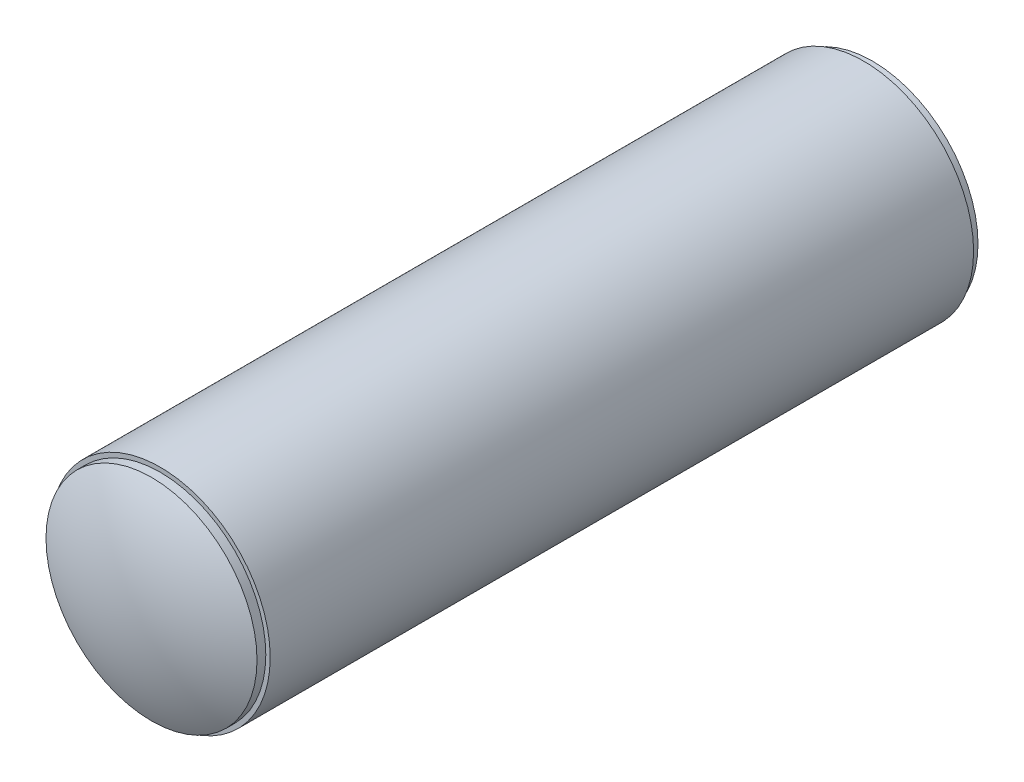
ISO-10303-21;
HEADER;
FILE_DESCRIPTION(('STEP AP214'),'2;1');
FILE_NAME('part.step','',(''),(''),'','','');
FILE_SCHEMA(('AUTOMOTIVE_DESIGN { 1 0 10303 214 1 1 1 1 }'));
ENDSEC;
DATA;
#1=APPLICATION_CONTEXT('core data for automotive mechanical design processes');
#2=APPLICATION_PROTOCOL_DEFINITION('international standard','automotive_design',2000,#1);
#3=PRODUCT_CONTEXT('',#1,'mechanical');
#4=PRODUCT('Part','Part','',(#3));
#5=PRODUCT_RELATED_PRODUCT_CATEGORY('part','',(#4));
#6=PRODUCT_DEFINITION_FORMATION('','',#4);
#7=PRODUCT_DEFINITION_CONTEXT('part definition',#1,'design');
#8=PRODUCT_DEFINITION('design','',#6,#7);
#9=PRODUCT_DEFINITION_SHAPE('','',#8);
#10=(LENGTH_UNIT() NAMED_UNIT(*) SI_UNIT(.MILLI.,.METRE.));
#11=(NAMED_UNIT(*) PLANE_ANGLE_UNIT() SI_UNIT($,.RADIAN.));
#12=(NAMED_UNIT(*) SI_UNIT($,.STERADIAN.) SOLID_ANGLE_UNIT());
#13=UNCERTAINTY_MEASURE_WITH_UNIT(LENGTH_MEASURE(1.E-05),#10,'distance_accuracy_value','');
#14=(GEOMETRIC_REPRESENTATION_CONTEXT(3) GLOBAL_UNCERTAINTY_ASSIGNED_CONTEXT((#13)) GLOBAL_UNIT_ASSIGNED_CONTEXT((#10,
#11,#12)) REPRESENTATION_CONTEXT('',''));
#15=CARTESIAN_POINT('',(0.,0.,0.));
#16=DIRECTION('',(0.,0.,1.));
#17=DIRECTION('',(1.,0.,0.));
#18=AXIS2_PLACEMENT_3D('',#15,#16,#17);
#19=CARTESIAN_POINT('',(0.,0.,5.));
#20=DIRECTION('',(0.,0.,-1.));
#21=DIRECTION('',(0.,1.,0.));
#22=AXIS2_PLACEMENT_3D('',#19,#20,#21);
#23=PLANE('',#22);
#24=CARTESIAN_POINT('',(0.,0.,5.));
#25=DIRECTION('',(0.,0.,1.));
#26=DIRECTION('',(0.,-1.,0.));
#27=AXIS2_PLACEMENT_3D('',#24,#25,#26);
#28=CIRCLE('',#27,1.);
#29=CARTESIAN_POINT('',(0.,-1.,5.));
#30=VERTEX_POINT('',#29);
#31=EDGE_CURVE('E54',#30,#30,#28,.T.);
#32=ORIENTED_EDGE('',*,*,#31,.F.);
#33=EDGE_LOOP('',(#32));
#34=FACE_BOUND('',#33,.T.);
#35=ADVANCED_FACE('F40',(#34),#23,.T.);
#36=CARTESIAN_POINT('',(0.,0.,3.7));
#37=DIRECTION('',(0.,0.,1.));
#38=DIRECTION('',(0.,1.,0.));
#39=AXIS2_PLACEMENT_3D('',#36,#37,#38);
#40=SPHERICAL_SURFACE('',#39,5.1);
#41=CARTESIAN_POINT('',(0.,0.,8.2));
#42=DIRECTION('',(0.,0.,1.));
#43=DIRECTION('',(0.,-1.,0.));
#44=AXIS2_PLACEMENT_3D('',#41,#42,#43);
#45=CIRCLE('',#44,2.4);
#46=CARTESIAN_POINT('',(0.,-2.4,8.2));
#47=VERTEX_POINT('',#46);
#48=EDGE_CURVE('E11',#47,#47,#45,.T.);
#49=ORIENTED_EDGE('',*,*,#48,.T.);
#50=EDGE_LOOP('',(#49));
#51=FACE_BOUND('',#50,.T.);
#52=ADVANCED_FACE('F64',(#51),#40,.T.);
#53=CARTESIAN_POINT('',(0.,0.,8.8));
#54=DIRECTION('',(0.,0.,1.));
#55=DIRECTION('',(0.,-1.,0.));
#56=AXIS2_PLACEMENT_3D('',#53,#54,#55);
#57=CYLINDRICAL_SURFACE('',#56,2.4);
#58=CARTESIAN_POINT('',(0.,0.,8.));
#59=DIRECTION('',(0.,0.,1.));
#60=DIRECTION('',(0.,-1.,0.));
#61=AXIS2_PLACEMENT_3D('',#58,#59,#60);
#62=CIRCLE('',#61,2.4);
#63=CARTESIAN_POINT('',(0.,-2.4,8.));
#64=VERTEX_POINT('',#63);
#65=EDGE_CURVE('E46',#64,#64,#62,.T.);
#66=ORIENTED_EDGE('',*,*,#65,.T.);
#67=EDGE_LOOP('',(#66));
#68=FACE_BOUND('',#67,.T.);
#69=ORIENTED_EDGE('',*,*,#48,.F.);
#70=EDGE_LOOP('',(#69));
#71=FACE_BOUND('',#70,.T.);
#72=ADVANCED_FACE('F68',(#68,#71),#57,.T.);
#73=CARTESIAN_POINT('',(0.,-1.,8.));
#74=DIRECTION('',(0.,0.,-1.));
#75=DIRECTION('',(0.,1.,0.));
#76=AXIS2_PLACEMENT_3D('',#73,#74,#75);
#77=PLANE('',#76);
#78=CARTESIAN_POINT('',(0.,0.,8.));
#79=DIRECTION('',(0.,0.,1.));
#80=DIRECTION('',(0.,-1.,0.));
#81=AXIS2_PLACEMENT_3D('',#78,#79,#80);
#82=CIRCLE('',#81,0.999999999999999);
#83=CARTESIAN_POINT('',(0.,-1.,8.));
#84=VERTEX_POINT('',#83);
#85=EDGE_CURVE('E50',#84,#84,#82,.T.);
#86=ORIENTED_EDGE('',*,*,#85,.T.);
#87=EDGE_LOOP('',(#86));
#88=FACE_BOUND('',#87,.T.);
#89=ORIENTED_EDGE('',*,*,#65,.F.);
#90=EDGE_LOOP('',(#89));
#91=FACE_BOUND('',#90,.T.);
#92=ADVANCED_FACE('F72',(#88,#91),#77,.T.);
#93=CARTESIAN_POINT('',(0.,0.,8.8));
#94=DIRECTION('',(0.,0.,1.));
#95=DIRECTION('',(0.,-1.,0.));
#96=AXIS2_PLACEMENT_3D('',#93,#94,#95);
#97=CYLINDRICAL_SURFACE('',#96,1.);
#98=ORIENTED_EDGE('',*,*,#31,.T.);
#99=EDGE_LOOP('',(#98));
#100=FACE_BOUND('',#99,.T.);
#101=ORIENTED_EDGE('',*,*,#85,.F.);
#102=EDGE_LOOP('',(#101));
#103=FACE_BOUND('',#102,.T.);
#104=ADVANCED_FACE('F60',(#100,#103),#97,.T.);
#105=CLOSED_SHELL('',(#35,#52,#72,#92,#104));
#106=MANIFOLD_SOLID_BREP('B2',#105);
#107=CARTESIAN_POINT('',(0.,0.,-3.7));
#108=DIRECTION('',(0.,0.,1.));
#109=DIRECTION('',(0.,-1.,0.));
#110=AXIS2_PLACEMENT_3D('',#107,#108,#109);
#111=SPHERICAL_SURFACE('',#110,5.1);
#112=CARTESIAN_POINT('',(0.,0.,-8.2));
#113=DIRECTION('',(0.,0.,1.));
#114=DIRECTION('',(0.,-1.,0.));
#115=AXIS2_PLACEMENT_3D('',#112,#113,#114);
#116=CIRCLE('',#115,2.4);
#117=CARTESIAN_POINT('',(0.,-2.4,-8.2));
#118=VERTEX_POINT('',#117);
#119=EDGE_CURVE('E39',#118,#118,#116,.T.);
#120=ORIENTED_EDGE('',*,*,#119,.F.);
#121=EDGE_LOOP('',(#120));
#122=FACE_BOUND('',#121,.T.);
#123=ADVANCED_FACE('F118',(#122),#111,.T.);
#124=CARTESIAN_POINT('',(0.,0.,8.8));
#125=DIRECTION('',(0.,0.,1.));
#126=DIRECTION('',(0.,-1.,0.));
#127=AXIS2_PLACEMENT_3D('',#124,#125,#126);
#128=CYLINDRICAL_SURFACE('',#127,2.4);
#129=ORIENTED_EDGE('',*,*,#119,.T.);
#130=EDGE_LOOP('',(#129));
#131=FACE_BOUND('',#130,.T.);
#132=CARTESIAN_POINT('',(0.,0.,-8.));
#133=DIRECTION('',(0.,0.,1.));
#134=DIRECTION('',(0.,-1.,0.));
#135=AXIS2_PLACEMENT_3D('',#132,#133,#134);
#136=CIRCLE('',#135,2.4);
#137=CARTESIAN_POINT('',(0.,-2.4,-8.));
#138=VERTEX_POINT('',#137);
#139=EDGE_CURVE('E124',#138,#138,#136,.T.);
#140=ORIENTED_EDGE('',*,*,#139,.F.);
#141=EDGE_LOOP('',(#140));
#142=FACE_BOUND('',#141,.T.);
#143=ADVANCED_FACE('F150',(#131,#142),#128,.T.);
#144=CARTESIAN_POINT('',(0.,-1.,-8.));
#145=DIRECTION('',(0.,0.,1.));
#146=DIRECTION('',(0.,-1.,0.));
#147=AXIS2_PLACEMENT_3D('',#144,#145,#146);
#148=PLANE('',#147);
#149=ORIENTED_EDGE('',*,*,#139,.T.);
#150=EDGE_LOOP('',(#149));
#151=FACE_BOUND('',#150,.T.);
#152=CARTESIAN_POINT('',(0.,0.,-8.));
#153=DIRECTION('',(0.,0.,1.));
#154=DIRECTION('',(0.,-1.,0.));
#155=AXIS2_PLACEMENT_3D('',#152,#153,#154);
#156=CIRCLE('',#155,1.);
#157=CARTESIAN_POINT('',(0.,-1.,-8.));
#158=VERTEX_POINT('',#157);
#159=EDGE_CURVE('E128',#158,#158,#156,.T.);
#160=ORIENTED_EDGE('',*,*,#159,.F.);
#161=EDGE_LOOP('',(#160));
#162=FACE_BOUND('',#161,.T.);
#163=ADVANCED_FACE('F142',(#151,#162),#148,.T.);
#164=CARTESIAN_POINT('',(0.,0.,8.8));
#165=DIRECTION('',(0.,0.,1.));
#166=DIRECTION('',(0.,-1.,0.));
#167=AXIS2_PLACEMENT_3D('',#164,#165,#166);
#168=CYLINDRICAL_SURFACE('',#167,1.);
#169=ORIENTED_EDGE('',*,*,#159,.T.);
#170=EDGE_LOOP('',(#169));
#171=FACE_BOUND('',#170,.T.);
#172=CARTESIAN_POINT('',(0.,0.,-5.));
#173=DIRECTION('',(0.,0.,1.));
#174=DIRECTION('',(0.,-1.,0.));
#175=AXIS2_PLACEMENT_3D('',#172,#173,#174);
#176=CIRCLE('',#175,1.);
#177=CARTESIAN_POINT('',(0.,-1.,-5.));
#178=VERTEX_POINT('',#177);
#179=EDGE_CURVE('E132',#178,#178,#176,.T.);
#180=ORIENTED_EDGE('',*,*,#179,.F.);
#181=EDGE_LOOP('',(#180));
#182=FACE_BOUND('',#181,.T.);
#183=ADVANCED_FACE('F140',(#171,#182),#168,.T.);
#184=CARTESIAN_POINT('',(0.,0.,-5.));
#185=DIRECTION('',(0.,0.,1.));
#186=DIRECTION('',(0.,-1.,0.));
#187=AXIS2_PLACEMENT_3D('',#184,#185,#186);
#188=PLANE('',#187);
#189=ORIENTED_EDGE('',*,*,#179,.T.);
#190=EDGE_LOOP('',(#189));
#191=FACE_BOUND('',#190,.T.);
#192=ADVANCED_FACE('F138',(#191),#188,.T.);
#193=CLOSED_SHELL('',(#123,#143,#163,#183,#192));
#194=MANIFOLD_SOLID_BREP('B6',#193);
#195=CARTESIAN_POINT('',(0.,0.,8.));
#196=DIRECTION('',(0.,0.,1.));
#197=DIRECTION('',(1.,0.,0.));
#198=AXIS2_PLACEMENT_3D('',#195,#196,#197);
#199=PLANE('',#198);
#200=CARTESIAN_POINT('',(0.,0.,8.));
#201=DIRECTION('',(0.,0.,1.));
#202=DIRECTION('',(1.,0.,0.));
#203=AXIS2_PLACEMENT_3D('',#200,#201,#202);
#204=CIRCLE('',#203,2.5);
#205=CARTESIAN_POINT('',(2.5,0.,8.));
#206=VERTEX_POINT('',#205);
#207=EDGE_CURVE('E117',#206,#206,#204,.T.);
#208=ORIENTED_EDGE('',*,*,#207,.T.);
#209=EDGE_LOOP('',(#208));
#210=FACE_BOUND('',#209,.T.);
#211=CARTESIAN_POINT('',(0.,0.,8.));
#212=DIRECTION('',(0.,0.,1.));
#213=DIRECTION('',(1.,0.,0.));
#214=AXIS2_PLACEMENT_3D('',#211,#212,#213);
#215=CIRCLE('',#214,1.);
#216=CARTESIAN_POINT('',(1.,0.,8.));
#217=VERTEX_POINT('',#216);
#218=EDGE_CURVE('E200',#217,#217,#215,.T.);
#219=ORIENTED_EDGE('',*,*,#218,.F.);
#220=EDGE_LOOP('',(#219));
#221=FACE_BOUND('',#220,.T.);
#222=ADVANCED_FACE('F189',(#210,#221),#199,.T.);
#223=CARTESIAN_POINT('',(0.,0.,-8.));
#224=DIRECTION('',(0.,0.,1.));
#225=DIRECTION('',(1.,0.,0.));
#226=AXIS2_PLACEMENT_3D('',#223,#224,#225);
#227=PLANE('',#226);
#228=CARTESIAN_POINT('',(0.,0.,-8.));
#229=DIRECTION('',(0.,0.,1.));
#230=DIRECTION('',(1.,0.,0.));
#231=AXIS2_PLACEMENT_3D('',#228,#229,#230);
#232=CIRCLE('',#231,2.5);
#233=CARTESIAN_POINT('',(2.5,0.,-8.));
#234=VERTEX_POINT('',#233);
#235=EDGE_CURVE('E193',#234,#234,#232,.T.);
#236=ORIENTED_EDGE('',*,*,#235,.F.);
#237=EDGE_LOOP('',(#236));
#238=FACE_BOUND('',#237,.T.);
#239=CARTESIAN_POINT('',(0.,0.,-8.));
#240=DIRECTION('',(0.,0.,1.));
#241=DIRECTION('',(1.,0.,0.));
#242=AXIS2_PLACEMENT_3D('',#239,#240,#241);
#243=CIRCLE('',#242,1.);
#244=CARTESIAN_POINT('',(1.,0.,-8.));
#245=VERTEX_POINT('',#244);
#246=EDGE_CURVE('E202',#245,#245,#243,.T.);
#247=ORIENTED_EDGE('',*,*,#246,.T.);
#248=EDGE_LOOP('',(#247));
#249=FACE_BOUND('',#248,.T.);
#250=ADVANCED_FACE('F212',(#238,#249),#227,.F.);
#251=CARTESIAN_POINT('',(0.,0.,8.));
#252=DIRECTION('',(0.,0.,-1.));
#253=DIRECTION('',(-1.,0.,0.));
#254=AXIS2_PLACEMENT_3D('',#251,#252,#253);
#255=CYLINDRICAL_SURFACE('',#254,2.5);
#256=ORIENTED_EDGE('',*,*,#207,.F.);
#257=EDGE_LOOP('',(#256));
#258=FACE_BOUND('',#257,.T.);
#259=ORIENTED_EDGE('',*,*,#235,.T.);
#260=EDGE_LOOP('',(#259));
#261=FACE_BOUND('',#260,.T.);
#262=ADVANCED_FACE('F191',(#258,#261),#255,.T.);
#263=CARTESIAN_POINT('',(0.,0.,8.));
#264=DIRECTION('',(0.,0.,-1.));
#265=DIRECTION('',(-1.,0.,0.));
#266=AXIS2_PLACEMENT_3D('',#263,#264,#265);
#267=CYLINDRICAL_SURFACE('',#266,1.);
#268=ORIENTED_EDGE('',*,*,#218,.T.);
#269=EDGE_LOOP('',(#268));
#270=FACE_BOUND('',#269,.T.);
#271=ORIENTED_EDGE('',*,*,#246,.F.);
#272=EDGE_LOOP('',(#271));
#273=FACE_BOUND('',#272,.T.);
#274=ADVANCED_FACE('F208',(#270,#273),#267,.F.);
#275=CLOSED_SHELL('',(#222,#250,#262,#274));
#276=MANIFOLD_SOLID_BREP('B34',#275);
#277=ADVANCED_BREP_SHAPE_REPRESENTATION('',(#18,#106,#194,#276),#14);
#278=SHAPE_DEFINITION_REPRESENTATION(#9,#277);
ENDSEC;
END-ISO-10303-21;
